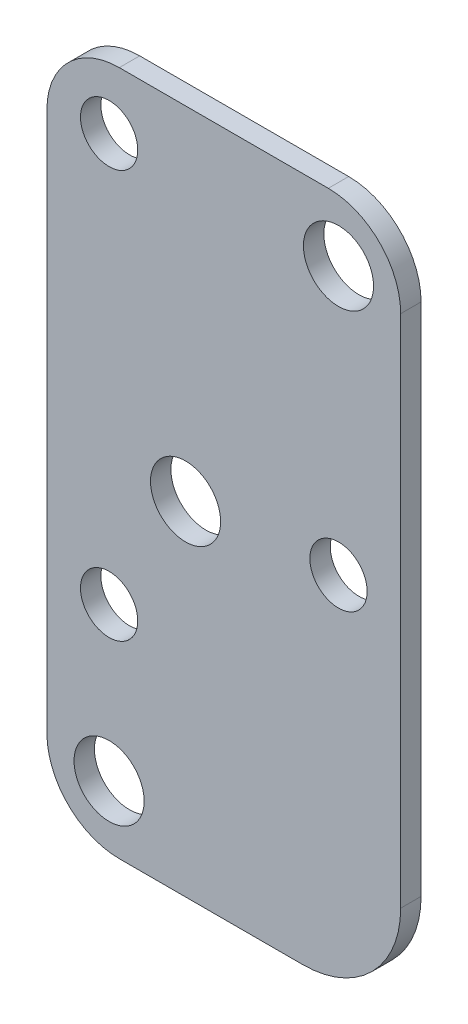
from build123d import *

# Parameters (mm, degrees)
BOSS_EXTRUDE1_DEPTH = 2.54
HOLE12_D            = 7.1374
HOLE1_D             = 8.7376


with BuildPart() as part:
    # Sketch2 → Boss-Extrude1 (new body)
    with BuildSketch(Plane(origin=(0, 0, 82.1182), x_dir=(-1, 0, 0), z_dir=(0, 0, -1))):
        with BuildLine():
            Line((147.955, 86.8172), (121.92, 86.8172))
            ThreePointArc((121.92, 86.8172), (115.544018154, 84.176181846), (112.903, 77.8002))
            Line((112.903, 77.8002), (112.903, 13.6652))
            ThreePointArc((112.903, 13.6652), (116.473954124, 5.044154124), (125.095, 1.4732))
            Line((125.095, 1.4732), (147.955, 1.4732))
            ThreePointArc((147.955, 1.4732), (154.330981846, 4.114218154), (156.972, 10.4902))
            Line((156.972, 10.4902), (156.972, 77.8002))
            ThreePointArc((156.972, 77.8002), (154.330981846, 84.176181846), (147.955, 86.8172))
        make_face()
    extrude(amount=-BOSS_EXTRUDE1_DEPTH)

    # Hole12 (through all)
    with Locations(Plane(origin=(-130.019260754, 64.017340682, 84.6582), x_dir=(1, 0, 0), z_dir=(0, 0, 1))):
        with Locations((-19.205739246, -35.747140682), (9.369260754, -18.284640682), (-19.205739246, 15.052859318)):
            Hole(HOLE12_D / 2)

    # Hole1 (through all)
    with Locations(Plane(origin=(-116.995739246, 89.671340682, 82.1182), x_dir=(-1, 0, 0), z_dir=(0, 0, -1))):
        with Locations((3.654260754, -10.601140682), (22.704260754, -45.526140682), (32.229260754, -80.451140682)):
            Hole(HOLE1_D / 2)


solid = part.part
